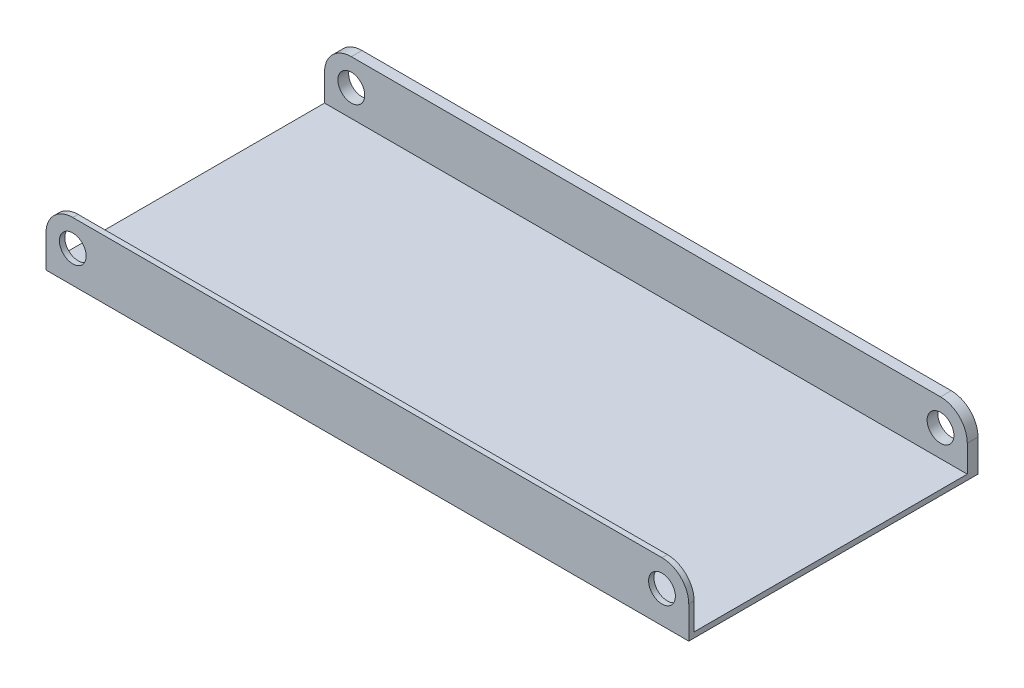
from build123d import *

# Parameters (mm, degrees)
SKETCH1_W           = 152.4
SKETCH1_H           = 68.58
BOSS_EXTRUDE1_DEPTH = 1.27
SKETCH2_W           = 152.4
SKETCH2_H           = 1.27
SKETCH2_H_2         = 2.54
BOSS_EXTRUDE2_DEPTH = 12.7
SKETCH3_R           = 3.175
CUT_EXTRUDE1_DEPTH  = 168.702526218
FILLET1_R           = 6.35


with BuildPart() as part:
    # Sketch1 → Boss-Extrude1 (new body)
    with BuildSketch(Plane(origin=(0, 0, 0), x_dir=(1, 0, 0), z_dir=(0, 1, 0))):
        with Locations((76.2, -34.29)):
            Rectangle(SKETCH1_W, SKETCH1_H)
    extrude(amount=BOSS_EXTRUDE1_DEPTH)

    # Sketch2 → Boss-Extrude2 (add)
    with BuildSketch(Plane(origin=(0, 1.27, 0), x_dir=(1, 0, 0), z_dir=(0, 1, 0))):
        with Locations((76.2, -67.945)):
            Rectangle(SKETCH2_W, SKETCH2_H)
        with Locations((76.2, -1.27)):
            Rectangle(SKETCH2_W, SKETCH2_H_2)
    extrude(amount=BOSS_EXTRUDE2_DEPTH)

    # Sketch3 → Cut-Extrude1 (cut, through all)
    with BuildSketch(Plane.XY.offset(68.58)):
        with Locations((6.35, 7.62)):
            Circle(SKETCH3_R)
        with Locations((146.05, 7.62)):
            Circle(SKETCH3_R)
    extrude(amount=-CUT_EXTRUDE1_DEPTH, mode=Mode.SUBTRACT)

    # Fillet1
    fillet1_edges = [part.edges().sort_by_distance(p)[0] for p in [
        (0, 13.97, 67.945),
        (152.4, 13.97, 67.945),
        (0, 13.97, 1.27),
        (152.4, 13.97, 1.27),
    ]]
    fillet(fillet1_edges, radius=FILLET1_R)


solid = part.part
